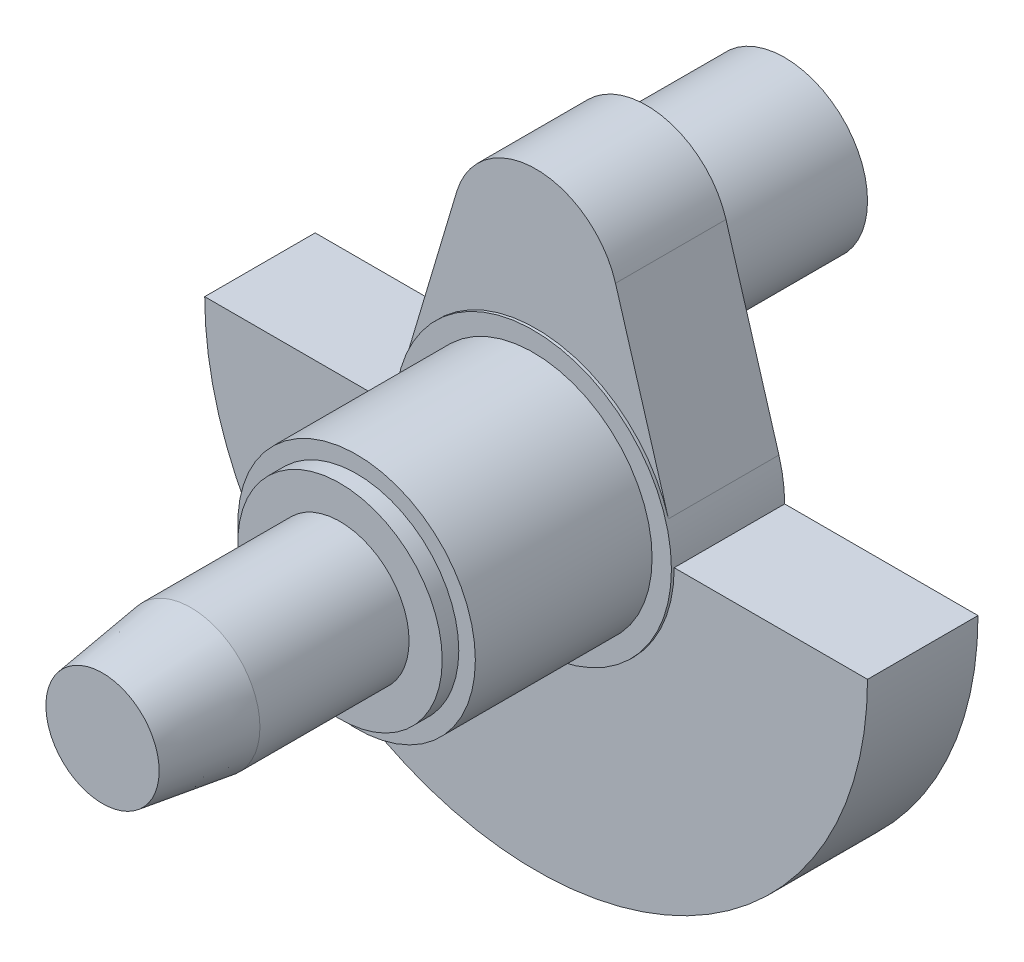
ISO-10303-21;
HEADER;
FILE_DESCRIPTION(('STEP AP214'),'2;1');
FILE_NAME('part.step','',(''),(''),'','','');
FILE_SCHEMA(('AUTOMOTIVE_DESIGN { 1 0 10303 214 1 1 1 1 }'));
ENDSEC;
DATA;
#1=APPLICATION_CONTEXT('core data for automotive mechanical design processes');
#2=APPLICATION_PROTOCOL_DEFINITION('international standard','automotive_design',2000,#1);
#3=PRODUCT_CONTEXT('',#1,'mechanical');
#4=PRODUCT('Part','Part','',(#3));
#5=PRODUCT_RELATED_PRODUCT_CATEGORY('part','',(#4));
#6=PRODUCT_DEFINITION_FORMATION('','',#4);
#7=PRODUCT_DEFINITION_CONTEXT('part definition',#1,'design');
#8=PRODUCT_DEFINITION('design','',#6,#7);
#9=PRODUCT_DEFINITION_SHAPE('','',#8);
#10=(LENGTH_UNIT() NAMED_UNIT(*) SI_UNIT(.MILLI.,.METRE.));
#11=(NAMED_UNIT(*) PLANE_ANGLE_UNIT() SI_UNIT($,.RADIAN.));
#12=(NAMED_UNIT(*) SI_UNIT($,.STERADIAN.) SOLID_ANGLE_UNIT());
#13=UNCERTAINTY_MEASURE_WITH_UNIT(LENGTH_MEASURE(1.E-05),#10,'distance_accuracy_value','');
#14=(GEOMETRIC_REPRESENTATION_CONTEXT(3) GLOBAL_UNCERTAINTY_ASSIGNED_CONTEXT((#13)) GLOBAL_UNIT_ASSIGNED_CONTEXT((#10,
#11,#12)) REPRESENTATION_CONTEXT('',''));
#15=CARTESIAN_POINT('',(0.,0.,0.));
#16=DIRECTION('',(0.,0.,1.));
#17=DIRECTION('',(1.,0.,0.));
#18=AXIS2_PLACEMENT_3D('',#15,#16,#17);
#19=CARTESIAN_POINT('',(0.,0.,-40.));
#20=DIRECTION('',(0.,0.,1.));
#21=DIRECTION('',(1.,0.,0.));
#22=AXIS2_PLACEMENT_3D('',#19,#20,#21);
#23=PLANE('',#22);
#24=CARTESIAN_POINT('',(0.,0.,-40.));
#25=DIRECTION('',(0.,0.,1.));
#26=DIRECTION('',(1.,0.,0.));
#27=AXIS2_PLACEMENT_3D('',#24,#25,#26);
#28=CIRCLE('',#27,50.);
#29=CARTESIAN_POINT('',(50.,0.,-40.));
#30=VERTEX_POINT('',#29);
#31=CARTESIAN_POINT('',(47.9157423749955,14.2857142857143,-40.));
#32=VERTEX_POINT('',#31);
#33=EDGE_CURVE('E43',#30,#32,#28,.T.);
#34=ORIENTED_EDGE('',*,*,#33,.F.);
#35=DIRECTION('',(1.,0.,0.));
#36=VECTOR('',#35,1.);
#37=CARTESIAN_POINT('',(0.,0.,-40.));
#38=LINE('',#37,#36);
#39=CARTESIAN_POINT('',(120.,0.,-40.));
#40=VERTEX_POINT('',#39);
#41=EDGE_CURVE('E141',#30,#40,#38,.T.);
#42=ORIENTED_EDGE('',*,*,#41,.T.);
#43=CARTESIAN_POINT('',(0.,0.,-40.));
#44=DIRECTION('',(0.,0.,1.));
#45=DIRECTION('',(1.,0.,0.));
#46=AXIS2_PLACEMENT_3D('',#43,#44,#45);
#47=CIRCLE('',#46,120.);
#48=CARTESIAN_POINT('',(-120.,0.,-40.));
#49=VERTEX_POINT('',#48);
#50=EDGE_CURVE('E137',#49,#40,#47,.T.);
#51=ORIENTED_EDGE('',*,*,#50,.F.);
#52=DIRECTION('',(-1.,0.,0.));
#53=VECTOR('',#52,1.);
#54=CARTESIAN_POINT('',(0.,0.,-40.));
#55=LINE('',#54,#53);
#56=CARTESIAN_POINT('',(-50.,0.,-40.));
#57=VERTEX_POINT('',#56);
#58=EDGE_CURVE('E134',#57,#49,#55,.T.);
#59=ORIENTED_EDGE('',*,*,#58,.F.);
#60=CARTESIAN_POINT('',(-47.9157423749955,14.2857142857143,-40.));
#61=VERTEX_POINT('',#60);
#62=EDGE_CURVE('E163',#61,#57,#28,.T.);
#63=ORIENTED_EDGE('',*,*,#62,.F.);
#64=DIRECTION('',(0.285714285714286,0.95831484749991,0.));
#65=VECTOR('',#64,1.);
#66=CARTESIAN_POINT('',(-47.9157423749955,14.2857142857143,-40.));
#67=LINE('',#66,#65);
#68=CARTESIAN_POINT('',(-28.7494454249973,78.5714285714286,-40.));
#69=VERTEX_POINT('',#68);
#70=EDGE_CURVE('E131',#61,#69,#67,.T.);
#71=ORIENTED_EDGE('',*,*,#70,.T.);
#72=CARTESIAN_POINT('',(0.,70.,-40.));
#73=DIRECTION('',(0.,0.,1.));
#74=DIRECTION('',(1.,0.,0.));
#75=AXIS2_PLACEMENT_3D('',#72,#73,#74);
#76=CIRCLE('',#75,30.);
#77=CARTESIAN_POINT('',(28.7494454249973,78.5714285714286,-40.));
#78=VERTEX_POINT('',#77);
#79=EDGE_CURVE('E106',#78,#69,#76,.T.);
#80=ORIENTED_EDGE('',*,*,#79,.F.);
#81=DIRECTION('',(-0.285714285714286,0.95831484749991,0.));
#82=VECTOR('',#81,1.);
#83=CARTESIAN_POINT('',(47.9157423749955,14.2857142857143,-40.));
#84=LINE('',#83,#82);
#85=EDGE_CURVE('E128',#32,#78,#84,.T.);
#86=ORIENTED_EDGE('',*,*,#85,.F.);
#87=EDGE_LOOP('',(#34,#42,#51,#59,#63,#71,#80,#86));
#88=FACE_BOUND('',#87,.T.);
#89=CARTESIAN_POINT('',(0.,60.,-40.));
#90=DIRECTION('',(0.,0.,1.));
#91=DIRECTION('',(1.,0.,0.));
#92=AXIS2_PLACEMENT_3D('',#89,#90,#91);
#93=CIRCLE('',#92,30.);
#94=CARTESIAN_POINT('',(30.,60.,-40.));
#95=VERTEX_POINT('',#94);
#96=EDGE_CURVE('E11',#95,#95,#93,.F.);
#97=ORIENTED_EDGE('',*,*,#96,.F.);
#98=EDGE_LOOP('',(#97));
#99=FACE_BOUND('',#98,.T.);
#100=ADVANCED_FACE('F35',(#88,#99),#23,.F.);
#101=CARTESIAN_POINT('',(0.,0.,1.));
#102=DIRECTION('',(0.,0.,1.));
#103=DIRECTION('',(1.,0.,0.));
#104=AXIS2_PLACEMENT_3D('',#101,#102,#103);
#105=PLANE('',#104);
#106=CARTESIAN_POINT('',(0.,0.,1.));
#107=DIRECTION('',(0.,0.,1.));
#108=DIRECTION('',(1.,0.,0.));
#109=AXIS2_PLACEMENT_3D('',#106,#107,#108);
#110=CIRCLE('',#109,50.);
#111=CARTESIAN_POINT('',(50.,0.,1.));
#112=VERTEX_POINT('',#111);
#113=EDGE_CURVE('E161',#112,#112,#110,.T.);
#114=ORIENTED_EDGE('',*,*,#113,.T.);
#115=EDGE_LOOP('',(#114));
#116=FACE_BOUND('',#115,.T.);
#117=CARTESIAN_POINT('',(0.,0.,1.00000000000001));
#118=DIRECTION('',(0.,0.,1.));
#119=DIRECTION('',(1.,0.,0.));
#120=AXIS2_PLACEMENT_3D('',#117,#118,#119);
#121=CIRCLE('',#120,43.);
#122=CARTESIAN_POINT('',(43.,0.,1.00000000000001));
#123=VERTEX_POINT('',#122);
#124=EDGE_CURVE('E118',#123,#123,#121,.T.);
#125=ORIENTED_EDGE('',*,*,#124,.F.);
#126=EDGE_LOOP('',(#125));
#127=FACE_BOUND('',#126,.T.);
#128=ADVANCED_FACE('F193',(#116,#127),#105,.T.);
#129=CARTESIAN_POINT('',(0.,0.,-40.));
#130=DIRECTION('',(0.,0.,1.));
#131=DIRECTION('',(1.,0.,0.));
#132=AXIS2_PLACEMENT_3D('',#129,#130,#131);
#133=CYLINDRICAL_SURFACE('',#132,50.);
#134=DIRECTION('',(0.,0.,1.));
#135=VECTOR('',#134,1.);
#136=CARTESIAN_POINT('',(47.9157423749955,14.2857142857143,-308.328157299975));
#137=LINE('',#136,#135);
#138=CARTESIAN_POINT('',(47.9157423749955,14.2857142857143,0.));
#139=VERTEX_POINT('',#138);
#140=EDGE_CURVE('E50',#32,#139,#137,.T.);
#141=ORIENTED_EDGE('',*,*,#140,.T.);
#142=CARTESIAN_POINT('',(0.,0.,0.));
#143=DIRECTION('',(0.,0.,1.));
#144=DIRECTION('',(1.,0.,0.));
#145=AXIS2_PLACEMENT_3D('',#142,#143,#144);
#146=CIRCLE('',#145,50.);
#147=CARTESIAN_POINT('',(-47.9157423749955,14.2857142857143,0.));
#148=VERTEX_POINT('',#147);
#149=EDGE_CURVE('E55',#139,#148,#146,.T.);
#150=ORIENTED_EDGE('',*,*,#149,.T.);
#151=DIRECTION('',(0.,0.,1.));
#152=VECTOR('',#151,1.);
#153=CARTESIAN_POINT('',(-47.9157423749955,14.2857142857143,-308.328157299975));
#154=LINE('',#153,#152);
#155=EDGE_CURVE('E110',#61,#148,#154,.T.);
#156=ORIENTED_EDGE('',*,*,#155,.F.);
#157=ORIENTED_EDGE('',*,*,#62,.T.);
#158=DIRECTION('',(0.,0.,1.));
#159=VECTOR('',#158,1.);
#160=CARTESIAN_POINT('',(-50.,0.,-308.328157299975));
#161=LINE('',#160,#159);
#162=CARTESIAN_POINT('',(-50.,0.,0.));
#163=VERTEX_POINT('',#162);
#164=EDGE_CURVE('E154',#57,#163,#161,.T.);
#165=ORIENTED_EDGE('',*,*,#164,.T.);
#166=CARTESIAN_POINT('',(0.,0.,0.));
#167=DIRECTION('',(0.,0.,1.));
#168=DIRECTION('',(1.,0.,0.));
#169=AXIS2_PLACEMENT_3D('',#166,#167,#168);
#170=CIRCLE('',#169,50.);
#171=CARTESIAN_POINT('',(50.,0.,0.));
#172=VERTEX_POINT('',#171);
#173=EDGE_CURVE('E147',#163,#172,#170,.T.);
#174=ORIENTED_EDGE('',*,*,#173,.T.);
#175=DIRECTION('',(0.,0.,1.));
#176=VECTOR('',#175,1.);
#177=CARTESIAN_POINT('',(50.,0.,-308.328157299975));
#178=LINE('',#177,#176);
#179=EDGE_CURVE('E156',#30,#172,#178,.T.);
#180=ORIENTED_EDGE('',*,*,#179,.F.);
#181=ORIENTED_EDGE('',*,*,#33,.T.);
#182=EDGE_LOOP('',(#141,#150,#156,#157,#165,#174,#180,#181));
#183=FACE_BOUND('',#182,.T.);
#184=ORIENTED_EDGE('',*,*,#113,.F.);
#185=EDGE_LOOP('',(#184));
#186=FACE_BOUND('',#185,.T.);
#187=ADVANCED_FACE('F37',(#183,#186),#133,.T.);
#188=CARTESIAN_POINT('',(0.,0.,-308.328157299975));
#189=DIRECTION('',(0.,0.,1.));
#190=DIRECTION('',(1.,0.,0.));
#191=AXIS2_PLACEMENT_3D('',#188,#189,#190);
#192=CYLINDRICAL_SURFACE('',#191,120.);
#193=DIRECTION('',(0.,0.,1.));
#194=VECTOR('',#193,1.);
#195=CARTESIAN_POINT('',(-120.,0.,-308.328157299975));
#196=LINE('',#195,#194);
#197=CARTESIAN_POINT('',(-120.,0.,0.));
#198=VERTEX_POINT('',#197);
#199=EDGE_CURVE('E138',#49,#198,#196,.T.);
#200=ORIENTED_EDGE('',*,*,#199,.F.);
#201=ORIENTED_EDGE('',*,*,#50,.T.);
#202=DIRECTION('',(0.,0.,1.));
#203=VECTOR('',#202,1.);
#204=CARTESIAN_POINT('',(120.,0.,-308.328157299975));
#205=LINE('',#204,#203);
#206=CARTESIAN_POINT('',(120.,0.,0.));
#207=VERTEX_POINT('',#206);
#208=EDGE_CURVE('E152',#40,#207,#205,.T.);
#209=ORIENTED_EDGE('',*,*,#208,.T.);
#210=CARTESIAN_POINT('',(0.,0.,0.));
#211=DIRECTION('',(0.,0.,1.));
#212=DIRECTION('',(1.,0.,0.));
#213=AXIS2_PLACEMENT_3D('',#210,#211,#212);
#214=CIRCLE('',#213,120.);
#215=EDGE_CURVE('E133',#207,#198,#214,.F.);
#216=ORIENTED_EDGE('',*,*,#215,.T.);
#217=EDGE_LOOP('',(#200,#201,#209,#216));
#218=FACE_BOUND('',#217,.T.);
#219=ADVANCED_FACE('F185',(#218),#192,.T.);
#220=CARTESIAN_POINT('',(0.,0.,-308.328157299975));
#221=DIRECTION('',(0.,-1.,0.));
#222=DIRECTION('',(0.,0.,-1.));
#223=AXIS2_PLACEMENT_3D('',#220,#221,#222);
#224=PLANE('',#223);
#225=ORIENTED_EDGE('',*,*,#164,.F.);
#226=ORIENTED_EDGE('',*,*,#58,.T.);
#227=ORIENTED_EDGE('',*,*,#199,.T.);
#228=DIRECTION('',(1.,0.,0.));
#229=VECTOR('',#228,1.);
#230=CARTESIAN_POINT('',(0.,0.,0.));
#231=LINE('',#230,#229);
#232=EDGE_CURVE('E149',#198,#163,#231,.T.);
#233=ORIENTED_EDGE('',*,*,#232,.T.);
#234=EDGE_LOOP('',(#225,#226,#227,#233));
#235=FACE_BOUND('',#234,.T.);
#236=ADVANCED_FACE('F173',(#235),#224,.F.);
#237=CARTESIAN_POINT('',(0.,0.,-308.328157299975));
#238=DIRECTION('',(0.,1.,0.));
#239=DIRECTION('',(0.,0.,1.));
#240=AXIS2_PLACEMENT_3D('',#237,#238,#239);
#241=PLANE('',#240);
#242=ORIENTED_EDGE('',*,*,#41,.F.);
#243=ORIENTED_EDGE('',*,*,#179,.T.);
#244=DIRECTION('',(-1.,0.,0.));
#245=VECTOR('',#244,1.);
#246=CARTESIAN_POINT('',(0.,0.,0.));
#247=LINE('',#246,#245);
#248=EDGE_CURVE('E144',#207,#172,#247,.T.);
#249=ORIENTED_EDGE('',*,*,#248,.F.);
#250=ORIENTED_EDGE('',*,*,#208,.F.);
#251=EDGE_LOOP('',(#242,#243,#249,#250));
#252=FACE_BOUND('',#251,.T.);
#253=ADVANCED_FACE('F182',(#252),#241,.T.);
#254=CARTESIAN_POINT('',(0.,0.,0.));
#255=DIRECTION('',(0.,0.,1.));
#256=DIRECTION('',(1.,0.,0.));
#257=AXIS2_PLACEMENT_3D('',#254,#255,#256);
#258=PLANE('',#257);
#259=ORIENTED_EDGE('',*,*,#215,.F.);
#260=ORIENTED_EDGE('',*,*,#248,.T.);
#261=ORIENTED_EDGE('',*,*,#173,.F.);
#262=ORIENTED_EDGE('',*,*,#232,.F.);
#263=EDGE_LOOP('',(#259,#260,#261,#262));
#264=FACE_BOUND('',#263,.T.);
#265=ADVANCED_FACE('F178',(#264),#258,.T.);
#266=CARTESIAN_POINT('',(0.,70.,-308.328157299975));
#267=DIRECTION('',(0.,0.,1.));
#268=DIRECTION('',(1.,0.,0.));
#269=AXIS2_PLACEMENT_3D('',#266,#267,#268);
#270=CYLINDRICAL_SURFACE('',#269,30.);
#271=DIRECTION('',(0.,0.,1.));
#272=VECTOR('',#271,1.);
#273=CARTESIAN_POINT('',(28.7494454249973,78.5714285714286,-308.328157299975));
#274=LINE('',#273,#272);
#275=CARTESIAN_POINT('',(28.7494454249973,78.5714285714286,0.));
#276=VERTEX_POINT('',#275);
#277=EDGE_CURVE('E126',#78,#276,#274,.T.);
#278=ORIENTED_EDGE('',*,*,#277,.F.);
#279=ORIENTED_EDGE('',*,*,#79,.T.);
#280=DIRECTION('',(0.,0.,1.));
#281=VECTOR('',#280,1.);
#282=CARTESIAN_POINT('',(-28.7494454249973,78.5714285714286,-308.328157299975));
#283=LINE('',#282,#281);
#284=CARTESIAN_POINT('',(-28.7494454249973,78.5714285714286,0.));
#285=VERTEX_POINT('',#284);
#286=EDGE_CURVE('E101',#69,#285,#283,.T.);
#287=ORIENTED_EDGE('',*,*,#286,.T.);
#288=CARTESIAN_POINT('',(0.,70.,0.));
#289=DIRECTION('',(0.,0.,1.));
#290=DIRECTION('',(1.,0.,0.));
#291=AXIS2_PLACEMENT_3D('',#288,#289,#290);
#292=CIRCLE('',#291,30.);
#293=EDGE_CURVE('E105',#285,#276,#292,.F.);
#294=ORIENTED_EDGE('',*,*,#293,.T.);
#295=EDGE_LOOP('',(#278,#279,#287,#294));
#296=FACE_BOUND('',#295,.T.);
#297=ADVANCED_FACE('F104',(#296),#270,.T.);
#298=CARTESIAN_POINT('',(47.9157423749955,14.2857142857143,-308.328157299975));
#299=DIRECTION('',(-0.95831484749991,-0.285714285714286,0.));
#300=DIRECTION('',(0.285714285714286,-0.95831484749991,0.));
#301=AXIS2_PLACEMENT_3D('',#298,#299,#300);
#302=PLANE('',#301);
#303=ORIENTED_EDGE('',*,*,#140,.F.);
#304=ORIENTED_EDGE('',*,*,#85,.T.);
#305=ORIENTED_EDGE('',*,*,#277,.T.);
#306=DIRECTION('',(0.285714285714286,-0.95831484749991,0.));
#307=VECTOR('',#306,1.);
#308=CARTESIAN_POINT('',(47.9157423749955,14.2857142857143,0.));
#309=LINE('',#308,#307);
#310=EDGE_CURVE('E111',#276,#139,#309,.T.);
#311=ORIENTED_EDGE('',*,*,#310,.T.);
#312=EDGE_LOOP('',(#303,#304,#305,#311));
#313=FACE_BOUND('',#312,.T.);
#314=ADVANCED_FACE('F221',(#313),#302,.F.);
#315=CARTESIAN_POINT('',(-47.9157423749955,14.2857142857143,-308.328157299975));
#316=DIRECTION('',(-0.95831484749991,0.285714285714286,0.));
#317=DIRECTION('',(-0.285714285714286,-0.95831484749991,0.));
#318=AXIS2_PLACEMENT_3D('',#315,#316,#317);
#319=PLANE('',#318);
#320=ORIENTED_EDGE('',*,*,#70,.F.);
#321=ORIENTED_EDGE('',*,*,#155,.T.);
#322=DIRECTION('',(-0.285714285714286,-0.95831484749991,0.));
#323=VECTOR('',#322,1.);
#324=CARTESIAN_POINT('',(-47.9157423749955,14.2857142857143,0.));
#325=LINE('',#324,#323);
#326=EDGE_CURVE('E117',#285,#148,#325,.T.);
#327=ORIENTED_EDGE('',*,*,#326,.F.);
#328=ORIENTED_EDGE('',*,*,#286,.F.);
#329=EDGE_LOOP('',(#320,#321,#327,#328));
#330=FACE_BOUND('',#329,.T.);
#331=ADVANCED_FACE('F120',(#330),#319,.T.);
#332=CARTESIAN_POINT('',(0.,0.,0.));
#333=DIRECTION('',(0.,0.,1.));
#334=DIRECTION('',(1.,0.,0.));
#335=AXIS2_PLACEMENT_3D('',#332,#333,#334);
#336=PLANE('',#335);
#337=ORIENTED_EDGE('',*,*,#293,.F.);
#338=ORIENTED_EDGE('',*,*,#326,.T.);
#339=ORIENTED_EDGE('',*,*,#149,.F.);
#340=ORIENTED_EDGE('',*,*,#310,.F.);
#341=EDGE_LOOP('',(#337,#338,#339,#340));
#342=FACE_BOUND('',#341,.T.);
#343=ADVANCED_FACE('F116',(#342),#336,.T.);
#344=CARTESIAN_POINT('',(0.,0.,125.));
#345=DIRECTION('',(0.,0.,1.));
#346=DIRECTION('',(1.,0.,0.));
#347=AXIS2_PLACEMENT_3D('',#344,#345,#346);
#348=CYLINDRICAL_SURFACE('',#347,43.);
#349=CARTESIAN_POINT('',(0.,0.,65.));
#350=DIRECTION('',(0.,0.,1.));
#351=DIRECTION('',(1.,0.,0.));
#352=AXIS2_PLACEMENT_3D('',#349,#350,#351);
#353=CIRCLE('',#352,43.);
#354=CARTESIAN_POINT('',(43.,0.,65.));
#355=VERTEX_POINT('',#354);
#356=EDGE_CURVE('E212',#355,#355,#353,.T.);
#357=ORIENTED_EDGE('',*,*,#356,.F.);
#358=EDGE_LOOP('',(#357));
#359=FACE_BOUND('',#358,.T.);
#360=ORIENTED_EDGE('',*,*,#124,.T.);
#361=EDGE_LOOP('',(#360));
#362=FACE_BOUND('',#361,.T.);
#363=ADVANCED_FACE('F264',(#359,#362),#348,.T.);
#364=CARTESIAN_POINT('',(0.,43.,65.));
#365=DIRECTION('',(0.,0.,-1.));
#366=DIRECTION('',(-1.,0.,0.));
#367=AXIS2_PLACEMENT_3D('',#364,#365,#366);
#368=PLANE('',#367);
#369=CARTESIAN_POINT('',(0.,0.,65.));
#370=DIRECTION('',(0.,0.,1.));
#371=DIRECTION('',(1.,0.,0.));
#372=AXIS2_PLACEMENT_3D('',#369,#370,#371);
#373=CIRCLE('',#372,37.);
#374=CARTESIAN_POINT('',(37.,0.,65.));
#375=VERTEX_POINT('',#374);
#376=EDGE_CURVE('E215',#375,#375,#373,.T.);
#377=ORIENTED_EDGE('',*,*,#376,.F.);
#378=EDGE_LOOP('',(#377));
#379=FACE_BOUND('',#378,.T.);
#380=ORIENTED_EDGE('',*,*,#356,.T.);
#381=EDGE_LOOP('',(#380));
#382=FACE_BOUND('',#381,.T.);
#383=ADVANCED_FACE('F283',(#379,#382),#368,.F.);
#384=CARTESIAN_POINT('',(0.,0.,125.));
#385=DIRECTION('',(0.,0.,1.));
#386=DIRECTION('',(1.,0.,0.));
#387=AXIS2_PLACEMENT_3D('',#384,#385,#386);
#388=CYLINDRICAL_SURFACE('',#387,37.);
#389=CARTESIAN_POINT('',(0.,0.,71.));
#390=DIRECTION('',(0.,0.,1.));
#391=DIRECTION('',(1.,0.,0.));
#392=AXIS2_PLACEMENT_3D('',#389,#390,#391);
#393=CIRCLE('',#392,37.);
#394=CARTESIAN_POINT('',(37.,0.,71.));
#395=VERTEX_POINT('',#394);
#396=EDGE_CURVE('E367',#395,#395,#393,.T.);
#397=ORIENTED_EDGE('',*,*,#396,.F.);
#398=EDGE_LOOP('',(#397));
#399=FACE_BOUND('',#398,.T.);
#400=ORIENTED_EDGE('',*,*,#376,.T.);
#401=EDGE_LOOP('',(#400));
#402=FACE_BOUND('',#401,.T.);
#403=ADVANCED_FACE('F289',(#399,#402),#388,.T.);
#404=CARTESIAN_POINT('',(0.,37.,71.));
#405=DIRECTION('',(0.,0.,-1.));
#406=DIRECTION('',(-1.,0.,0.));
#407=AXIS2_PLACEMENT_3D('',#404,#405,#406);
#408=PLANE('',#407);
#409=CARTESIAN_POINT('',(0.,0.,71.));
#410=DIRECTION('',(0.,0.,1.));
#411=DIRECTION('',(1.,0.,0.));
#412=AXIS2_PLACEMENT_3D('',#409,#410,#411);
#413=CIRCLE('',#412,25.);
#414=CARTESIAN_POINT('',(25.,0.,71.));
#415=VERTEX_POINT('',#414);
#416=EDGE_CURVE('E364',#415,#415,#413,.T.);
#417=ORIENTED_EDGE('',*,*,#416,.F.);
#418=EDGE_LOOP('',(#417));
#419=FACE_BOUND('',#418,.T.);
#420=ORIENTED_EDGE('',*,*,#396,.T.);
#421=EDGE_LOOP('',(#420));
#422=FACE_BOUND('',#421,.T.);
#423=ADVANCED_FACE('F297',(#419,#422),#408,.F.);
#424=CARTESIAN_POINT('',(0.,0.,125.));
#425=DIRECTION('',(0.,0.,1.));
#426=DIRECTION('',(1.,0.,0.));
#427=AXIS2_PLACEMENT_3D('',#424,#425,#426);
#428=CYLINDRICAL_SURFACE('',#427,25.);
#429=CARTESIAN_POINT('',(0.,0.,125.));
#430=DIRECTION('',(0.,0.,1.));
#431=DIRECTION('',(1.,0.,0.));
#432=AXIS2_PLACEMENT_3D('',#429,#430,#431);
#433=CIRCLE('',#432,25.);
#434=CARTESIAN_POINT('',(25.,0.,125.));
#435=VERTEX_POINT('',#434);
#436=EDGE_CURVE('E359',#435,#435,#433,.T.);
#437=ORIENTED_EDGE('',*,*,#436,.F.);
#438=EDGE_LOOP('',(#437));
#439=FACE_BOUND('',#438,.T.);
#440=ORIENTED_EDGE('',*,*,#416,.T.);
#441=EDGE_LOOP('',(#440));
#442=FACE_BOUND('',#441,.T.);
#443=ADVANCED_FACE('F305',(#439,#442),#428,.T.);
#444=CARTESIAN_POINT('',(0.,0.,125.));
#445=DIRECTION('',(0.,0.,-1.));
#446=DIRECTION('',(1.,0.,0.));
#447=AXIS2_PLACEMENT_3D('',#444,#445,#446);
#448=CONICAL_SURFACE('',#447,25.,0.139626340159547);
#449=CARTESIAN_POINT('',(0.,0.,157.));
#450=DIRECTION('',(0.,0.,1.));
#451=DIRECTION('',(1.,0.,0.));
#452=AXIS2_PLACEMENT_3D('',#449,#450,#451);
#453=CIRCLE('',#452,20.5026932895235);
#454=CARTESIAN_POINT('',(20.5026932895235,0.,157.));
#455=VERTEX_POINT('',#454);
#456=EDGE_CURVE('E356',#455,#455,#453,.T.);
#457=ORIENTED_EDGE('',*,*,#456,.F.);
#458=EDGE_LOOP('',(#457));
#459=FACE_BOUND('',#458,.T.);
#460=ORIENTED_EDGE('',*,*,#436,.T.);
#461=EDGE_LOOP('',(#460));
#462=FACE_BOUND('',#461,.T.);
#463=ADVANCED_FACE('F313',(#459,#462),#448,.T.);
#464=CARTESIAN_POINT('',(0.,0.,157.));
#465=DIRECTION('',(0.,0.,1.));
#466=DIRECTION('',(1.,0.,0.));
#467=AXIS2_PLACEMENT_3D('',#464,#465,#466);
#468=PLANE('',#467);
#469=ORIENTED_EDGE('',*,*,#456,.T.);
#470=EDGE_LOOP('',(#469));
#471=FACE_BOUND('',#470,.T.);
#472=ADVANCED_FACE('F321',(#471),#468,.T.);
#473=CARTESIAN_POINT('',(0.,60.,-90.));
#474=DIRECTION('',(0.,0.,1.));
#475=DIRECTION('',(1.,0.,0.));
#476=AXIS2_PLACEMENT_3D('',#473,#474,#475);
#477=CYLINDRICAL_SURFACE('',#476,30.);
#478=CARTESIAN_POINT('',(0.,60.,-90.));
#479=DIRECTION('',(0.,0.,-1.));
#480=DIRECTION('',(-1.,0.,0.));
#481=AXIS2_PLACEMENT_3D('',#478,#479,#480);
#482=CIRCLE('',#481,30.);
#483=CARTESIAN_POINT('',(-30.,60.,-90.));
#484=VERTEX_POINT('',#483);
#485=EDGE_CURVE('E355',#484,#484,#482,.T.);
#486=ORIENTED_EDGE('',*,*,#485,.F.);
#487=EDGE_LOOP('',(#486));
#488=FACE_BOUND('',#487,.T.);
#489=ORIENTED_EDGE('',*,*,#96,.T.);
#490=EDGE_LOOP('',(#489));
#491=FACE_BOUND('',#490,.T.);
#492=ADVANCED_FACE('F328',(#488,#491),#477,.T.);
#493=CARTESIAN_POINT('',(0.,60.,-90.));
#494=DIRECTION('',(0.,0.,-1.));
#495=DIRECTION('',(-1.,0.,0.));
#496=AXIS2_PLACEMENT_3D('',#493,#494,#495);
#497=PLANE('',#496);
#498=ORIENTED_EDGE('',*,*,#485,.T.);
#499=EDGE_LOOP('',(#498));
#500=FACE_BOUND('',#499,.T.);
#501=ADVANCED_FACE('F334',(#500),#497,.T.);
#502=CLOSED_SHELL('',(#100,#128,#187,#219,#236,#253,#265,#297,#314,#331,#343,#363,#383,#403,
#423,#443,#463,#472,#492,#501));
#503=MANIFOLD_SOLID_BREP('B2',#502);
#504=ADVANCED_BREP_SHAPE_REPRESENTATION('',(#18,#503),#14);
#505=SHAPE_DEFINITION_REPRESENTATION(#9,#504);
ENDSEC;
END-ISO-10303-21;
